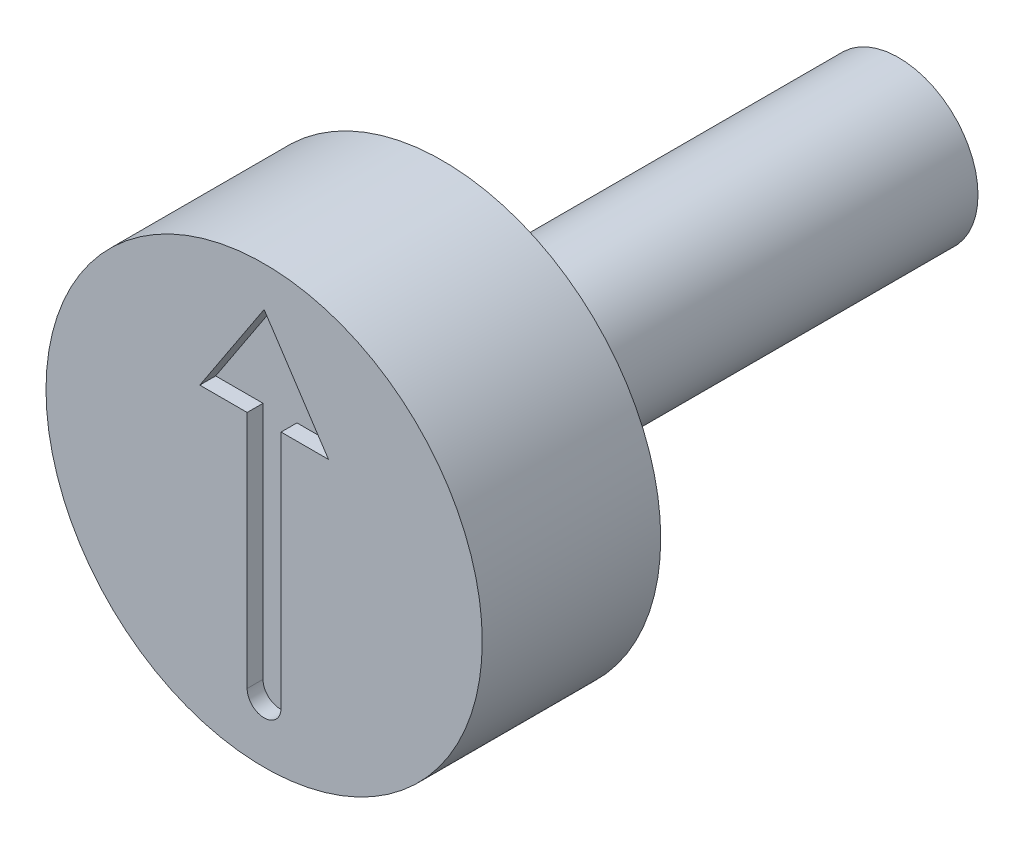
from build123d import *

# Parameters (mm, degrees)
CUT_EXTRUDE1_DEPTH = 0.4


with BuildPart() as part:
    # Sketch2 → Revolve1 (revolve)
    with BuildSketch(Plane(origin=(0, 0, 0), x_dir=(1, 0, 0), z_dir=(0, 1, 0))):
        Polygon((5.5, 0), (5.5, 4.5), (2, 4.5), (2, 16), (0, 16), (0, 0), align=None)
    revolve(axis=Axis((0, 0, 0), (0, 0, -1)))

    # Sketch3 → Cut-Extrude1 (cut)
    with BuildSketch(Plane.XY):
        with BuildLine():
            Line((-0.428009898, 2.036651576), (-1.622212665, 2.036651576))
            Line((-1.622212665, 2.036651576), (0, 4.498929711))
            Line((0, 4.498929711), (1.622212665, 2.036651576))
            Line((1.622212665, 2.036651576), (0.428009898, 2.036651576))
            Line((0.428009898, 2.036651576), (0.428009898, -3.991192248))
            ThreePointArc((0.428009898, -3.991192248), (0, -4.419202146), (-0.428009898, -3.991192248))
            Line((-0.428009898, -3.991192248), (-0.428009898, 2.036651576))
        make_face()
    extrude(amount=-CUT_EXTRUDE1_DEPTH, mode=Mode.SUBTRACT)


solid = part.part
